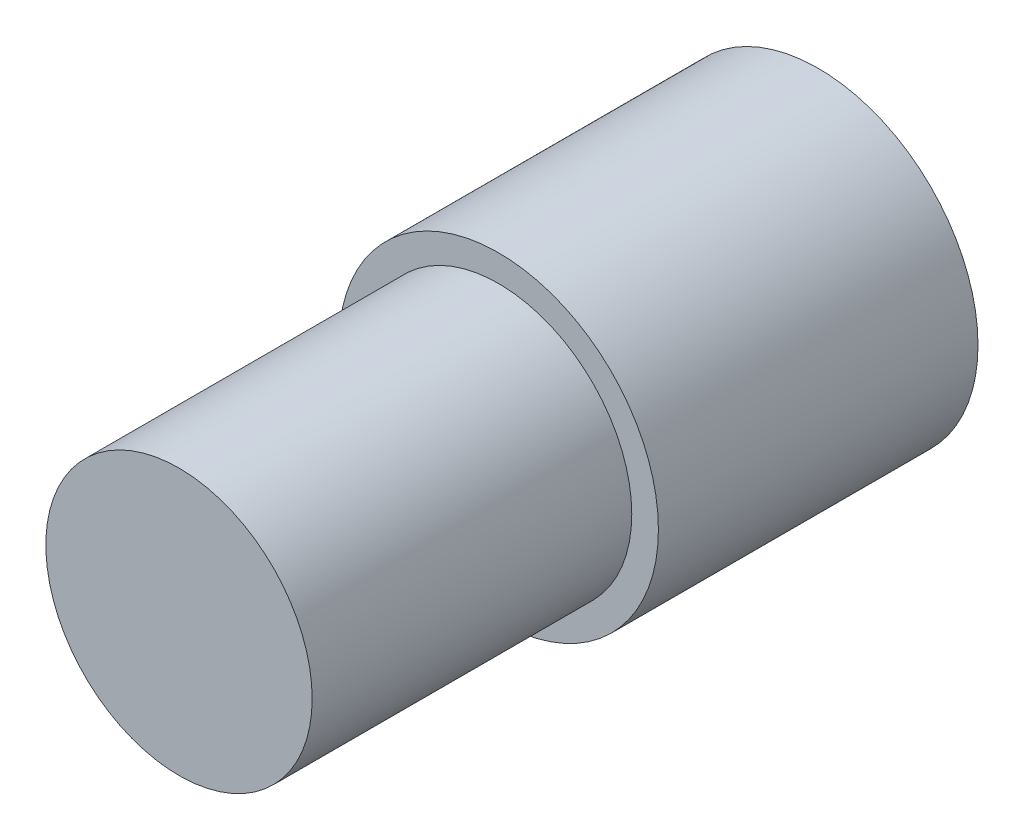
from build123d import *

# Parameters (mm, degrees)
CROQUIS1_R              = 6
SALIENTE_EXTRUIR1_DEPTH = 12
CROQUIS2_R              = 5
SALIENTE_EXTRUIR2_DEPTH = 12


with BuildPart() as part:
    # Croquis1 → Saliente-Extruir1 (new body)
    with BuildSketch(Plane.XY):
        Circle(CROQUIS1_R)
    extrude(amount=SALIENTE_EXTRUIR1_DEPTH)

    # Croquis2 → Saliente-Extruir2 (add)
    with BuildSketch(Plane.XY.offset(12)):
        Circle(CROQUIS2_R)
    extrude(amount=SALIENTE_EXTRUIR2_DEPTH)


solid = part.part
